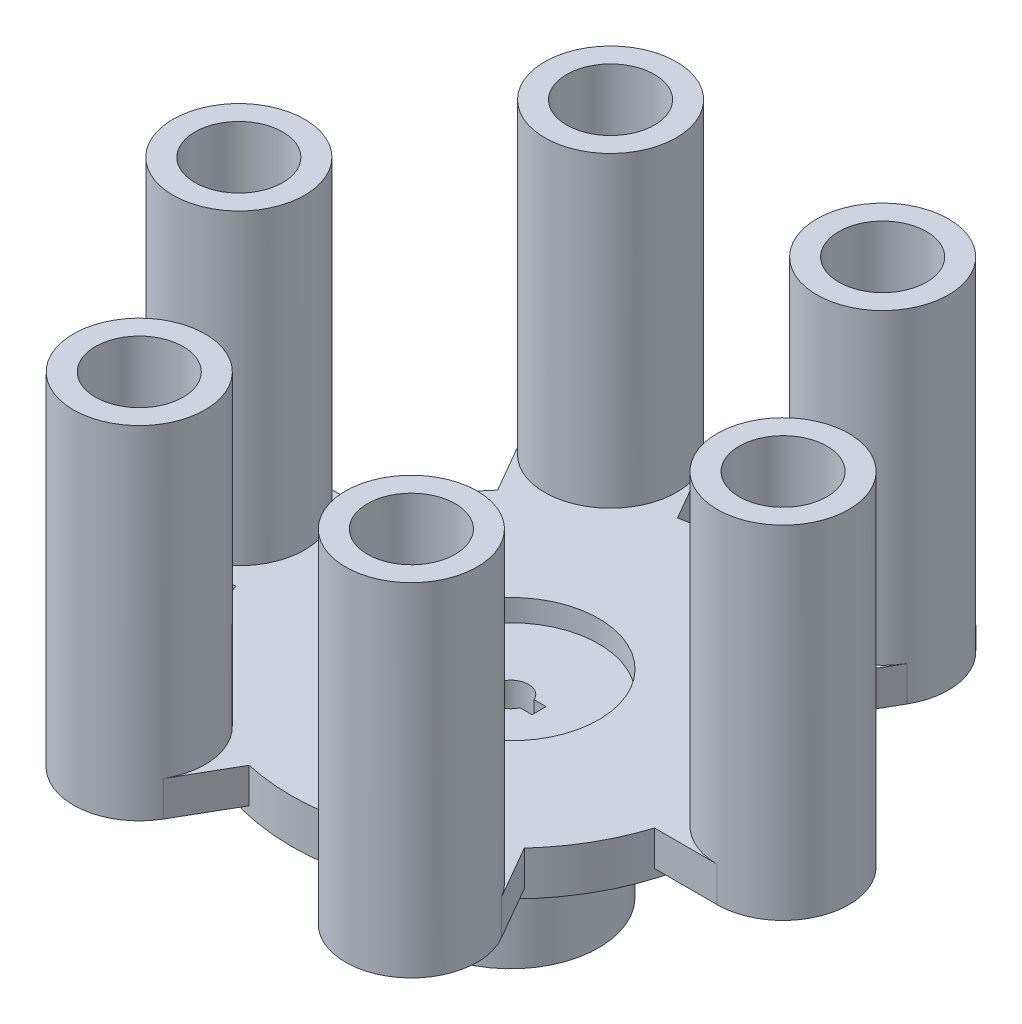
ISO-10303-21;
HEADER;
FILE_DESCRIPTION(('STEP AP214'),'2;1');
FILE_NAME('part.step','',(''),(''),'','','');
FILE_SCHEMA(('AUTOMOTIVE_DESIGN { 1 0 10303 214 1 1 1 1 }'));
ENDSEC;
DATA;
#1=APPLICATION_CONTEXT('core data for automotive mechanical design processes');
#2=APPLICATION_PROTOCOL_DEFINITION('international standard','automotive_design',2000,#1);
#3=PRODUCT_CONTEXT('',#1,'mechanical');
#4=PRODUCT('Part','Part','',(#3));
#5=PRODUCT_RELATED_PRODUCT_CATEGORY('part','',(#4));
#6=PRODUCT_DEFINITION_FORMATION('','',#4);
#7=PRODUCT_DEFINITION_CONTEXT('part definition',#1,'design');
#8=PRODUCT_DEFINITION('design','',#6,#7);
#9=PRODUCT_DEFINITION_SHAPE('','',#8);
#10=(LENGTH_UNIT() NAMED_UNIT(*) SI_UNIT(.MILLI.,.METRE.));
#11=(NAMED_UNIT(*) PLANE_ANGLE_UNIT() SI_UNIT($,.RADIAN.));
#12=(NAMED_UNIT(*) SI_UNIT($,.STERADIAN.) SOLID_ANGLE_UNIT());
#13=UNCERTAINTY_MEASURE_WITH_UNIT(LENGTH_MEASURE(1.E-05),#10,'distance_accuracy_value','');
#14=(GEOMETRIC_REPRESENTATION_CONTEXT(3) GLOBAL_UNCERTAINTY_ASSIGNED_CONTEXT((#13)) GLOBAL_UNIT_ASSIGNED_CONTEXT((#10,
#11,#12)) REPRESENTATION_CONTEXT('',''));
#15=CARTESIAN_POINT('',(0.,0.,0.));
#16=DIRECTION('',(0.,0.,1.));
#17=DIRECTION('',(1.,0.,0.));
#18=AXIS2_PLACEMENT_3D('',#15,#16,#17);
#19=CARTESIAN_POINT('',(0.,12.5,0.));
#20=DIRECTION('',(0.,1.,0.));
#21=DIRECTION('',(0.,0.,1.));
#22=AXIS2_PLACEMENT_3D('',#19,#20,#21);
#23=PLANE('',#22);
#24=CARTESIAN_POINT('',(0.,12.5,0.));
#25=DIRECTION('',(0.,1.,0.));
#26=DIRECTION('',(0.,0.,1.));
#27=AXIS2_PLACEMENT_3D('',#24,#25,#26);
#28=CIRCLE('',#27,10.);
#29=CARTESIAN_POINT('',(0.,12.5,10.));
#30=VERTEX_POINT('',#29);
#31=EDGE_CURVE('E393',#30,#30,#28,.T.);
#32=ORIENTED_EDGE('',*,*,#31,.F.);
#33=EDGE_LOOP('',(#32));
#34=FACE_BOUND('',#33,.T.);
#35=DIRECTION('',(-1.,0.,0.));
#36=VECTOR('',#35,1.);
#37=CARTESIAN_POINT('',(-31.0000000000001,12.5,-7.49999999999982));
#38=LINE('',#37,#36);
#39=CARTESIAN_POINT('',(-23.8484800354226,12.5,-7.49999999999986));
#40=VERTEX_POINT('',#39);
#41=CARTESIAN_POINT('',(-31.0000000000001,12.5,-7.49999999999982));
#42=VERTEX_POINT('',#41);
#43=EDGE_CURVE('E232',#40,#42,#38,.T.);
#44=ORIENTED_EDGE('',*,*,#43,.T.);
#45=CARTESIAN_POINT('',(-31.,12.5,2.20309881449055E-13));
#46=DIRECTION('',(0.,1.,0.));
#47=DIRECTION('',(-0.866025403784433,0.,0.50000000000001));
#48=AXIS2_PLACEMENT_3D('',#45,#46,#47);
#49=CIRCLE('',#48,7.49999999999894);
#50=CARTESIAN_POINT('',(-31.,12.5,7.49999999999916));
#51=VERTEX_POINT('',#50);
#52=EDGE_CURVE('E241',#51,#42,#49,.T.);
#53=ORIENTED_EDGE('',*,*,#52,.F.);
#54=DIRECTION('',(1.,0.,0.));
#55=VECTOR('',#54,1.);
#56=CARTESIAN_POINT('',(-30.9999999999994,12.5,7.49999999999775));
#57=LINE('',#56,#55);
#58=CARTESIAN_POINT('',(-23.8484800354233,12.5,7.49999999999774));
#59=VERTEX_POINT('',#58);
#60=EDGE_CURVE('E222',#51,#59,#57,.T.);
#61=ORIENTED_EDGE('',*,*,#60,.T.);
#62=CARTESIAN_POINT('',(0.,12.5,0.));
#63=DIRECTION('',(0.,1.,0.));
#64=DIRECTION('',(0.,0.,1.));
#65=AXIS2_PLACEMENT_3D('',#62,#63,#64);
#66=CIRCLE('',#65,24.999999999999);
#67=CARTESIAN_POINT('',(-18.4194305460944,12.5,16.9033895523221));
#68=VERTEX_POINT('',#67);
#69=EDGE_CURVE('E1133',#59,#68,#66,.T.);
#70=ORIENTED_EDGE('',*,*,#69,.T.);
#71=DIRECTION('',(-0.499999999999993,0.,0.866025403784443));
#72=VECTOR('',#71,1.);
#73=CARTESIAN_POINT('',(-21.9951905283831,12.5,23.0967875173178));
#74=LINE('',#73,#72);
#75=CARTESIAN_POINT('',(-21.9951905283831,12.5,23.0967875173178));
#76=VERTEX_POINT('',#75);
#77=EDGE_CURVE('E346',#68,#76,#74,.T.);
#78=ORIENTED_EDGE('',*,*,#77,.T.);
#79=CARTESIAN_POINT('',(-15.5000000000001,12.5,26.8467875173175));
#80=DIRECTION('',(0.,1.,0.));
#81=DIRECTION('',(0.,0.,1.));
#82=AXIS2_PLACEMENT_3D('',#79,#80,#81);
#83=CIRCLE('',#82,7.49999999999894);
#84=CARTESIAN_POINT('',(-9.00480947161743,12.5,30.5967875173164));
#85=VERTEX_POINT('',#84);
#86=EDGE_CURVE('E290',#85,#76,#83,.T.);
#87=ORIENTED_EDGE('',*,*,#86,.F.);
#88=DIRECTION('',(0.499999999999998,0.,-0.866025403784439));
#89=VECTOR('',#88,1.);
#90=CARTESIAN_POINT('',(-9.00480947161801,12.5,30.5967875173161));
#91=LINE('',#90,#89);
#92=CARTESIAN_POINT('',(-5.42904948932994,12.5,24.4033895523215));
#93=VERTEX_POINT('',#92);
#94=EDGE_CURVE('E340',#85,#93,#91,.T.);
#95=ORIENTED_EDGE('',*,*,#94,.T.);
#96=CARTESIAN_POINT('',(5.42904948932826,12.5,24.4033895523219));
#97=VERTEX_POINT('',#96);
#98=EDGE_CURVE('E1130',#93,#97,#66,.T.);
#99=ORIENTED_EDGE('',*,*,#98,.T.);
#100=DIRECTION('',(0.500000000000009,0.,0.866025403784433));
#101=VECTOR('',#100,1.);
#102=CARTESIAN_POINT('',(9.00480947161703,12.5,30.5967875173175));
#103=LINE('',#102,#101);
#104=CARTESIAN_POINT('',(9.00480947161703,12.5,30.5967875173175));
#105=VERTEX_POINT('',#104);
#106=EDGE_CURVE('E364',#97,#105,#103,.T.);
#107=ORIENTED_EDGE('',*,*,#106,.T.);
#108=CARTESIAN_POINT('',(15.4999999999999,12.5,26.8467875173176));
#109=DIRECTION('',(0.,1.,0.));
#110=DIRECTION('',(0.86602540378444,0.,0.499999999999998));
#111=AXIS2_PLACEMENT_3D('',#108,#109,#110);
#112=CIRCLE('',#111,7.49999999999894);
#113=CARTESIAN_POINT('',(21.9951905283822,12.5,23.0967875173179));
#114=VERTEX_POINT('',#113);
#115=EDGE_CURVE('E281',#114,#105,#112,.T.);
#116=ORIENTED_EDGE('',*,*,#115,.F.);
#117=DIRECTION('',(-0.500000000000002,0.,-0.866025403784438));
#118=VECTOR('',#117,1.);
#119=CARTESIAN_POINT('',(21.9951905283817,12.5,23.0967875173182));
#120=LINE('',#119,#118);
#121=CARTESIAN_POINT('',(18.4194305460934,12.5,16.9033895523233));
#122=VERTEX_POINT('',#121);
#123=EDGE_CURVE('E357',#114,#122,#120,.T.);
#124=ORIENTED_EDGE('',*,*,#123,.T.);
#125=CARTESIAN_POINT('',(23.8484800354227,12.5,7.4999999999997));
#126=VERTEX_POINT('',#125);
#127=EDGE_CURVE('E404',#122,#126,#66,.T.);
#128=ORIENTED_EDGE('',*,*,#127,.T.);
#129=DIRECTION('',(1.,0.,0.));
#130=VECTOR('',#129,1.);
#131=CARTESIAN_POINT('',(31.,12.5,7.49999999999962));
#132=LINE('',#131,#130);
#133=CARTESIAN_POINT('',(31.,12.5,7.49999999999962));
#134=VERTEX_POINT('',#133);
#135=EDGE_CURVE('E382',#126,#134,#132,.T.);
#136=ORIENTED_EDGE('',*,*,#135,.T.);
#137=CARTESIAN_POINT('',(31.,12.5,0.));
#138=DIRECTION('',(0.,1.,0.));
#139=DIRECTION('',(0.866025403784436,0.,-0.500000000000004));
#140=AXIS2_PLACEMENT_3D('',#137,#138,#139);
#141=CIRCLE('',#140,7.49999999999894);
#142=CARTESIAN_POINT('',(31.,12.5,-7.49999999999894));
#143=VERTEX_POINT('',#142);
#144=EDGE_CURVE('E272',#143,#134,#141,.T.);
#145=ORIENTED_EDGE('',*,*,#144,.F.);
#146=DIRECTION('',(-1.,0.,0.));
#147=VECTOR('',#146,1.);
#148=CARTESIAN_POINT('',(31.,12.5,-7.49999999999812));
#149=LINE('',#148,#147);
#150=CARTESIAN_POINT('',(23.8484800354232,12.5,-7.49999999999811));
#151=VERTEX_POINT('',#150);
#152=EDGE_CURVE('E375',#143,#151,#149,.T.);
#153=ORIENTED_EDGE('',*,*,#152,.T.);
#154=CARTESIAN_POINT('',(18.4194305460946,12.5,-16.903389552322));
#155=VERTEX_POINT('',#154);
#156=EDGE_CURVE('E399',#151,#155,#66,.T.);
#157=ORIENTED_EDGE('',*,*,#156,.T.);
#158=DIRECTION('',(0.499999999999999,0.,-0.866025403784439));
#159=VECTOR('',#158,1.);
#160=CARTESIAN_POINT('',(21.9951905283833,12.5,-23.0967875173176));
#161=LINE('',#160,#159);
#162=CARTESIAN_POINT('',(21.9951905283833,12.5,-23.0967875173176));
#163=VERTEX_POINT('',#162);
#164=EDGE_CURVE('E306',#155,#163,#161,.T.);
#165=ORIENTED_EDGE('',*,*,#164,.T.);
#166=CARTESIAN_POINT('',(15.5000000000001,12.5,-26.8467875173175));
#167=DIRECTION('',(0.,1.,0.));
#168=DIRECTION('',(0.,0.,-1.));
#169=AXIS2_PLACEMENT_3D('',#166,#167,#168);
#170=CIRCLE('',#169,7.49999999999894);
#171=CARTESIAN_POINT('',(9.00480947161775,12.5,-30.596787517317));
#172=VERTEX_POINT('',#171);
#173=EDGE_CURVE('E263',#172,#163,#170,.T.);
#174=ORIENTED_EDGE('',*,*,#173,.F.);
#175=DIRECTION('',(-0.499999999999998,0.,0.86602540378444));
#176=VECTOR('',#175,1.);
#177=CARTESIAN_POINT('',(9.00480947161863,12.5,-30.5967875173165));
#178=LINE('',#177,#176);
#179=CARTESIAN_POINT('',(5.4290494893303,12.5,-24.4033895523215));
#180=VERTEX_POINT('',#179);
#181=EDGE_CURVE('E54',#172,#180,#178,.T.);
#182=ORIENTED_EDGE('',*,*,#181,.T.);
#183=CARTESIAN_POINT('',(-5.42904948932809,12.5,-24.403389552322));
#184=VERTEX_POINT('',#183);
#185=EDGE_CURVE('E403',#180,#184,#66,.T.);
#186=ORIENTED_EDGE('',*,*,#185,.T.);
#187=DIRECTION('',(-0.500000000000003,0.,-0.866025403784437));
#188=VECTOR('',#187,1.);
#189=CARTESIAN_POINT('',(-9.00480947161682,12.5,-30.5967875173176));
#190=LINE('',#189,#188);
#191=CARTESIAN_POINT('',(-9.00480947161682,12.5,-30.5967875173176));
#192=VERTEX_POINT('',#191);
#193=EDGE_CURVE('E323',#184,#192,#190,.T.);
#194=ORIENTED_EDGE('',*,*,#193,.T.);
#195=CARTESIAN_POINT('',(-15.5000000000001,12.5,-26.8467875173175));
#196=DIRECTION('',(0.,1.,0.));
#197=DIRECTION('',(-0.866025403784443,0.,-0.499999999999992));
#198=AXIS2_PLACEMENT_3D('',#195,#196,#197);
#199=CIRCLE('',#198,7.49999999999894);
#200=CARTESIAN_POINT('',(-21.9951905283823,12.5,-23.0967875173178));
#201=VERTEX_POINT('',#200);
#202=EDGE_CURVE('E260',#201,#192,#199,.T.);
#203=ORIENTED_EDGE('',*,*,#202,.F.);
#204=DIRECTION('',(0.500000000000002,0.,0.866025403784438));
#205=VECTOR('',#204,1.);
#206=CARTESIAN_POINT('',(-21.995190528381,12.5,-23.0967875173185));
#207=LINE('',#206,#205);
#208=CARTESIAN_POINT('',(-18.4194305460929,12.5,-16.9033895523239));
#209=VERTEX_POINT('',#208);
#210=EDGE_CURVE('E61',#201,#209,#207,.T.);
#211=ORIENTED_EDGE('',*,*,#210,.T.);
#212=EDGE_CURVE('E1134',#209,#40,#66,.T.);
#213=ORIENTED_EDGE('',*,*,#212,.T.);
#214=EDGE_LOOP('',(#44,#53,#61,#70,#78,#87,#95,#99,#107,#116,#124,#128,#136,#145,#153,#157,#165,
#174,#182,#186,#194,#203,#211,#213));
#215=FACE_BOUND('',#214,.T.);
#216=ADVANCED_FACE('F37',(#34,#215),#23,.T.);
#217=CARTESIAN_POINT('',(0.,10.,0.));
#218=DIRECTION('',(0.,-1.,0.));
#219=DIRECTION('',(0.,0.,-1.));
#220=AXIS2_PLACEMENT_3D('',#217,#218,#219);
#221=CYLINDRICAL_SURFACE('',#220,10.);
#222=CARTESIAN_POINT('',(0.,-10.,0.));
#223=DIRECTION('',(0.,1.,0.));
#224=DIRECTION('',(0.,0.,1.));
#225=AXIS2_PLACEMENT_3D('',#222,#223,#224);
#226=CIRCLE('',#225,10.);
#227=CARTESIAN_POINT('',(0.,-10.,10.));
#228=VERTEX_POINT('',#227);
#229=EDGE_CURVE('E431',#228,#228,#226,.T.);
#230=ORIENTED_EDGE('',*,*,#229,.T.);
#231=EDGE_LOOP('',(#230));
#232=FACE_BOUND('',#231,.T.);
#233=CARTESIAN_POINT('',(0.,7.5,0.));
#234=DIRECTION('',(0.,1.,0.));
#235=DIRECTION('',(0.,0.,1.));
#236=AXIS2_PLACEMENT_3D('',#233,#234,#235);
#237=CIRCLE('',#236,10.);
#238=CARTESIAN_POINT('',(0.,7.5,10.));
#239=VERTEX_POINT('',#238);
#240=EDGE_CURVE('E443',#239,#239,#237,.T.);
#241=ORIENTED_EDGE('',*,*,#240,.F.);
#242=EDGE_LOOP('',(#241));
#243=FACE_BOUND('',#242,.T.);
#244=ADVANCED_FACE('F39',(#232,#243),#221,.T.);
#245=CARTESIAN_POINT('',(0.,10.,0.));
#246=DIRECTION('',(0.,1.,0.));
#247=DIRECTION('',(0.,0.,1.));
#248=AXIS2_PLACEMENT_3D('',#245,#246,#247);
#249=PLANE('',#248);
#250=DIRECTION('',(1.,0.,0.));
#251=VECTOR('',#250,1.);
#252=CARTESIAN_POINT('',(1.59788848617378,10.,0.8));
#253=LINE('',#252,#251);
#254=CARTESIAN_POINT('',(1.83303027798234,10.,0.8));
#255=VERTEX_POINT('',#254);
#256=CARTESIAN_POINT('',(3.2,10.,0.8));
#257=VERTEX_POINT('',#256);
#258=EDGE_CURVE('E414',#255,#257,#253,.T.);
#259=ORIENTED_EDGE('',*,*,#258,.F.);
#260=CARTESIAN_POINT('',(0.,10.,0.));
#261=DIRECTION('',(0.,1.,0.));
#262=DIRECTION('',(0.,0.,1.));
#263=AXIS2_PLACEMENT_3D('',#260,#261,#262);
#264=CIRCLE('',#263,2.);
#265=CARTESIAN_POINT('',(1.83303027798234,10.,-0.8));
#266=VERTEX_POINT('',#265);
#267=EDGE_CURVE('E428',#266,#255,#264,.T.);
#268=ORIENTED_EDGE('',*,*,#267,.F.);
#269=DIRECTION('',(-1.,0.,0.));
#270=VECTOR('',#269,1.);
#271=CARTESIAN_POINT('',(1.59788848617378,10.,-0.8));
#272=LINE('',#271,#270);
#273=CARTESIAN_POINT('',(3.2,10.,-0.8));
#274=VERTEX_POINT('',#273);
#275=EDGE_CURVE('E412',#274,#266,#272,.T.);
#276=ORIENTED_EDGE('',*,*,#275,.F.);
#277=DIRECTION('',(0.,0.,-1.));
#278=VECTOR('',#277,1.);
#279=CARTESIAN_POINT('',(3.2,10.,-0.8));
#280=LINE('',#279,#278);
#281=EDGE_CURVE('E409',#257,#274,#280,.T.);
#282=ORIENTED_EDGE('',*,*,#281,.F.);
#283=EDGE_LOOP('',(#259,#268,#276,#282));
#284=FACE_BOUND('',#283,.T.);
#285=CARTESIAN_POINT('',(0.,10.,0.));
#286=DIRECTION('',(0.,1.,0.));
#287=DIRECTION('',(0.,0.,1.));
#288=AXIS2_PLACEMENT_3D('',#285,#286,#287);
#289=CIRCLE('',#288,10.);
#290=CARTESIAN_POINT('',(0.,10.,10.));
#291=VERTEX_POINT('',#290);
#292=EDGE_CURVE('E402',#291,#291,#289,.F.);
#293=ORIENTED_EDGE('',*,*,#292,.F.);
#294=EDGE_LOOP('',(#293));
#295=FACE_BOUND('',#294,.T.);
#296=ADVANCED_FACE('F549',(#284,#295),#249,.T.);
#297=CARTESIAN_POINT('',(0.,-10.,0.));
#298=DIRECTION('',(0.,1.,0.));
#299=DIRECTION('',(0.,0.,1.));
#300=AXIS2_PLACEMENT_3D('',#297,#298,#299);
#301=PLANE('',#300);
#302=ORIENTED_EDGE('',*,*,#229,.F.);
#303=EDGE_LOOP('',(#302));
#304=FACE_BOUND('',#303,.T.);
#305=CARTESIAN_POINT('',(0.,-10.,0.));
#306=DIRECTION('',(0.,1.,0.));
#307=DIRECTION('',(0.,0.,1.));
#308=AXIS2_PLACEMENT_3D('',#305,#306,#307);
#309=CIRCLE('',#308,2.);
#310=CARTESIAN_POINT('',(1.83303027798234,-10.,-0.8));
#311=VERTEX_POINT('',#310);
#312=CARTESIAN_POINT('',(1.83303027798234,-10.,0.8));
#313=VERTEX_POINT('',#312);
#314=EDGE_CURVE('E427',#311,#313,#309,.T.);
#315=ORIENTED_EDGE('',*,*,#314,.T.);
#316=DIRECTION('',(1.,0.,0.));
#317=VECTOR('',#316,1.);
#318=CARTESIAN_POINT('',(0.,-10.,0.8));
#319=LINE('',#318,#317);
#320=CARTESIAN_POINT('',(3.2,-10.,0.8));
#321=VERTEX_POINT('',#320);
#322=EDGE_CURVE('E424',#313,#321,#319,.T.);
#323=ORIENTED_EDGE('',*,*,#322,.T.);
#324=DIRECTION('',(0.,0.,-1.));
#325=VECTOR('',#324,1.);
#326=CARTESIAN_POINT('',(3.2,-10.,0.));
#327=LINE('',#326,#325);
#328=CARTESIAN_POINT('',(3.2,-10.,-0.8));
#329=VERTEX_POINT('',#328);
#330=EDGE_CURVE('E440',#321,#329,#327,.T.);
#331=ORIENTED_EDGE('',*,*,#330,.T.);
#332=DIRECTION('',(-1.,0.,0.));
#333=VECTOR('',#332,1.);
#334=CARTESIAN_POINT('',(0.,-10.,-0.8));
#335=LINE('',#334,#333);
#336=EDGE_CURVE('E420',#329,#311,#335,.T.);
#337=ORIENTED_EDGE('',*,*,#336,.T.);
#338=EDGE_LOOP('',(#315,#323,#331,#337));
#339=FACE_BOUND('',#338,.T.);
#340=ADVANCED_FACE('F577',(#304,#339),#301,.F.);
#341=CARTESIAN_POINT('',(0.,10.,0.));
#342=DIRECTION('',(0.,-1.,0.));
#343=DIRECTION('',(0.,0.,-1.));
#344=AXIS2_PLACEMENT_3D('',#341,#342,#343);
#345=CYLINDRICAL_SURFACE('',#344,2.);
#346=DIRECTION('',(0.,-1.,0.));
#347=VECTOR('',#346,1.);
#348=CARTESIAN_POINT('',(1.83303027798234,10.,0.8));
#349=LINE('',#348,#347);
#350=EDGE_CURVE('E438',#313,#255,#349,.F.);
#351=ORIENTED_EDGE('',*,*,#350,.F.);
#352=ORIENTED_EDGE('',*,*,#314,.F.);
#353=DIRECTION('',(0.,-1.,0.));
#354=VECTOR('',#353,1.);
#355=CARTESIAN_POINT('',(1.83303027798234,10.,-0.8));
#356=LINE('',#355,#354);
#357=EDGE_CURVE('E436',#266,#311,#356,.T.);
#358=ORIENTED_EDGE('',*,*,#357,.F.);
#359=ORIENTED_EDGE('',*,*,#267,.T.);
#360=EDGE_LOOP('',(#351,#352,#358,#359));
#361=FACE_BOUND('',#360,.T.);
#362=ADVANCED_FACE('F573',(#361),#345,.F.);
#363=CARTESIAN_POINT('',(3.2,-20.,-0.8));
#364=DIRECTION('',(1.,0.,0.));
#365=DIRECTION('',(0.,0.,-1.));
#366=AXIS2_PLACEMENT_3D('',#363,#364,#365);
#367=PLANE('',#366);
#368=DIRECTION('',(0.,1.,0.));
#369=VECTOR('',#368,1.);
#370=CARTESIAN_POINT('',(3.2,-20.,0.8));
#371=LINE('',#370,#369);
#372=EDGE_CURVE('E418',#321,#257,#371,.T.);
#373=ORIENTED_EDGE('',*,*,#372,.T.);
#374=ORIENTED_EDGE('',*,*,#281,.T.);
#375=DIRECTION('',(0.,1.,0.));
#376=VECTOR('',#375,1.);
#377=CARTESIAN_POINT('',(3.2,-20.,-0.8));
#378=LINE('',#377,#376);
#379=EDGE_CURVE('E417',#329,#274,#378,.T.);
#380=ORIENTED_EDGE('',*,*,#379,.F.);
#381=ORIENTED_EDGE('',*,*,#330,.F.);
#382=EDGE_LOOP('',(#373,#374,#380,#381));
#383=FACE_BOUND('',#382,.T.);
#384=ADVANCED_FACE('F566',(#383),#367,.F.);
#385=CARTESIAN_POINT('',(1.59788848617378,-20.,0.8));
#386=DIRECTION('',(0.,0.,1.));
#387=DIRECTION('',(1.,0.,0.));
#388=AXIS2_PLACEMENT_3D('',#385,#386,#387);
#389=PLANE('',#388);
#390=ORIENTED_EDGE('',*,*,#350,.T.);
#391=ORIENTED_EDGE('',*,*,#258,.T.);
#392=ORIENTED_EDGE('',*,*,#372,.F.);
#393=ORIENTED_EDGE('',*,*,#322,.F.);
#394=EDGE_LOOP('',(#390,#391,#392,#393));
#395=FACE_BOUND('',#394,.T.);
#396=ADVANCED_FACE('F563',(#395),#389,.F.);
#397=CARTESIAN_POINT('',(1.59788848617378,-20.,-0.8));
#398=DIRECTION('',(0.,0.,-1.));
#399=DIRECTION('',(-1.,0.,0.));
#400=AXIS2_PLACEMENT_3D('',#397,#398,#399);
#401=PLANE('',#400);
#402=ORIENTED_EDGE('',*,*,#379,.T.);
#403=ORIENTED_EDGE('',*,*,#275,.T.);
#404=ORIENTED_EDGE('',*,*,#357,.T.);
#405=ORIENTED_EDGE('',*,*,#336,.F.);
#406=EDGE_LOOP('',(#402,#403,#404,#405));
#407=FACE_BOUND('',#406,.T.);
#408=ADVANCED_FACE('F558',(#407),#401,.F.);
#409=CARTESIAN_POINT('',(0.,7.5,0.));
#410=DIRECTION('',(0.,1.,0.));
#411=DIRECTION('',(0.,0.,1.));
#412=AXIS2_PLACEMENT_3D('',#409,#410,#411);
#413=PLANE('',#412);
#414=CARTESIAN_POINT('',(0.,7.5,0.));
#415=DIRECTION('',(0.,1.,0.));
#416=DIRECTION('',(0.,0.,1.));
#417=AXIS2_PLACEMENT_3D('',#414,#415,#416);
#418=CIRCLE('',#417,24.999999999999);
#419=CARTESIAN_POINT('',(0.,7.5,24.999999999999));
#420=VERTEX_POINT('',#419);
#421=EDGE_CURVE('E398',#420,#420,#418,.T.);
#422=ORIENTED_EDGE('',*,*,#421,.F.);
#423=EDGE_LOOP('',(#422));
#424=FACE_BOUND('',#423,.T.);
#425=ORIENTED_EDGE('',*,*,#240,.T.);
#426=EDGE_LOOP('',(#425));
#427=FACE_BOUND('',#426,.T.);
#428=ADVANCED_FACE('F554',(#424,#427),#413,.F.);
#429=CARTESIAN_POINT('',(0.,12.5,0.));
#430=DIRECTION('',(0.,-1.,0.));
#431=DIRECTION('',(0.,0.,-1.));
#432=AXIS2_PLACEMENT_3D('',#429,#430,#431);
#433=CYLINDRICAL_SURFACE('',#432,24.999999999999);
#434=CARTESIAN_POINT('',(0.,8.5,0.));
#435=DIRECTION('',(0.,1.,0.));
#436=DIRECTION('',(0.,0.,1.));
#437=AXIS2_PLACEMENT_3D('',#434,#435,#436);
#438=CIRCLE('',#437,24.999999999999);
#439=CARTESIAN_POINT('',(18.4194305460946,8.5,-16.903389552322));
#440=VERTEX_POINT('',#439);
#441=CARTESIAN_POINT('',(5.4290494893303,8.5,-24.4033895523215));
#442=VERTEX_POINT('',#441);
#443=EDGE_CURVE('E484',#440,#442,#438,.T.);
#444=ORIENTED_EDGE('',*,*,#443,.F.);
#445=DIRECTION('',(0.,-1.,0.));
#446=VECTOR('',#445,1.);
#447=CARTESIAN_POINT('',(18.4194305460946,12.5,-16.903389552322));
#448=LINE('',#447,#446);
#449=EDGE_CURVE('E11',#440,#155,#448,.F.);
#450=ORIENTED_EDGE('',*,*,#449,.T.);
#451=ORIENTED_EDGE('',*,*,#156,.F.);
#452=DIRECTION('',(0.,-1.,0.));
#453=VECTOR('',#452,1.);
#454=CARTESIAN_POINT('',(23.8484800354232,12.5,-7.49999999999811));
#455=LINE('',#454,#453);
#456=CARTESIAN_POINT('',(23.8484800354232,8.5,-7.49999999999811));
#457=VERTEX_POINT('',#456);
#458=EDGE_CURVE('E448',#151,#457,#455,.T.);
#459=ORIENTED_EDGE('',*,*,#458,.T.);
#460=CARTESIAN_POINT('',(0.,8.5,0.));
#461=DIRECTION('',(0.,1.,0.));
#462=DIRECTION('',(0.,0.,1.));
#463=AXIS2_PLACEMENT_3D('',#460,#461,#462);
#464=CIRCLE('',#463,24.999999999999);
#465=CARTESIAN_POINT('',(23.8484800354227,8.5,7.4999999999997));
#466=VERTEX_POINT('',#465);
#467=EDGE_CURVE('E446',#466,#457,#464,.T.);
#468=ORIENTED_EDGE('',*,*,#467,.F.);
#469=DIRECTION('',(0.,-1.,0.));
#470=VECTOR('',#469,1.);
#471=CARTESIAN_POINT('',(23.8484800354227,12.5,7.4999999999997));
#472=LINE('',#471,#470);
#473=EDGE_CURVE('E451',#466,#126,#472,.F.);
#474=ORIENTED_EDGE('',*,*,#473,.T.);
#475=ORIENTED_EDGE('',*,*,#127,.F.);
#476=DIRECTION('',(0.,-1.,0.));
#477=VECTOR('',#476,1.);
#478=CARTESIAN_POINT('',(18.4194305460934,12.5,16.9033895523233));
#479=LINE('',#478,#477);
#480=CARTESIAN_POINT('',(18.4194305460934,8.5,16.9033895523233));
#481=VERTEX_POINT('',#480);
#482=EDGE_CURVE('E456',#122,#481,#479,.T.);
#483=ORIENTED_EDGE('',*,*,#482,.T.);
#484=CARTESIAN_POINT('',(0.,8.5,0.));
#485=DIRECTION('',(0.,1.,0.));
#486=DIRECTION('',(0.,0.,1.));
#487=AXIS2_PLACEMENT_3D('',#484,#485,#486);
#488=CIRCLE('',#487,24.999999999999);
#489=CARTESIAN_POINT('',(5.42904948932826,8.5,24.4033895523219));
#490=VERTEX_POINT('',#489);
#491=EDGE_CURVE('E454',#490,#481,#488,.T.);
#492=ORIENTED_EDGE('',*,*,#491,.F.);
#493=DIRECTION('',(0.,-1.,0.));
#494=VECTOR('',#493,1.);
#495=CARTESIAN_POINT('',(5.42904948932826,12.5,24.4033895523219));
#496=LINE('',#495,#494);
#497=EDGE_CURVE('E459',#490,#97,#496,.F.);
#498=ORIENTED_EDGE('',*,*,#497,.T.);
#499=ORIENTED_EDGE('',*,*,#98,.F.);
#500=DIRECTION('',(0.,-1.,0.));
#501=VECTOR('',#500,1.);
#502=CARTESIAN_POINT('',(-5.42904948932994,12.5,24.4033895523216));
#503=LINE('',#502,#501);
#504=CARTESIAN_POINT('',(-5.42904948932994,8.5,24.4033895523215));
#505=VERTEX_POINT('',#504);
#506=EDGE_CURVE('E464',#93,#505,#503,.T.);
#507=ORIENTED_EDGE('',*,*,#506,.T.);
#508=CARTESIAN_POINT('',(0.,8.5,0.));
#509=DIRECTION('',(0.,1.,0.));
#510=DIRECTION('',(0.,0.,1.));
#511=AXIS2_PLACEMENT_3D('',#508,#509,#510);
#512=CIRCLE('',#511,24.999999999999);
#513=CARTESIAN_POINT('',(-18.4194305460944,8.5,16.9033895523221));
#514=VERTEX_POINT('',#513);
#515=EDGE_CURVE('E462',#514,#505,#512,.T.);
#516=ORIENTED_EDGE('',*,*,#515,.F.);
#517=DIRECTION('',(0.,-1.,0.));
#518=VECTOR('',#517,1.);
#519=CARTESIAN_POINT('',(-18.4194305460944,12.5,16.9033895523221));
#520=LINE('',#519,#518);
#521=EDGE_CURVE('E467',#514,#68,#520,.F.);
#522=ORIENTED_EDGE('',*,*,#521,.T.);
#523=ORIENTED_EDGE('',*,*,#69,.F.);
#524=DIRECTION('',(0.,-1.,0.));
#525=VECTOR('',#524,1.);
#526=CARTESIAN_POINT('',(-23.8484800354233,12.5,7.49999999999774));
#527=LINE('',#526,#525);
#528=CARTESIAN_POINT('',(-23.8484800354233,8.5,7.49999999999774));
#529=VERTEX_POINT('',#528);
#530=EDGE_CURVE('E229',#59,#529,#527,.T.);
#531=ORIENTED_EDGE('',*,*,#530,.T.);
#532=CARTESIAN_POINT('',(0.,8.5,0.));
#533=DIRECTION('',(0.,1.,0.));
#534=DIRECTION('',(0.,0.,1.));
#535=AXIS2_PLACEMENT_3D('',#532,#533,#534);
#536=CIRCLE('',#535,24.999999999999);
#537=CARTESIAN_POINT('',(-23.8484800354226,8.5,-7.49999999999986));
#538=VERTEX_POINT('',#537);
#539=EDGE_CURVE('E470',#538,#529,#536,.T.);
#540=ORIENTED_EDGE('',*,*,#539,.F.);
#541=DIRECTION('',(0.,-1.,0.));
#542=VECTOR('',#541,1.);
#543=CARTESIAN_POINT('',(-23.8484800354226,12.5,-7.49999999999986));
#544=LINE('',#543,#542);
#545=EDGE_CURVE('E473',#538,#40,#544,.F.);
#546=ORIENTED_EDGE('',*,*,#545,.T.);
#547=ORIENTED_EDGE('',*,*,#212,.F.);
#548=DIRECTION('',(0.,-1.,0.));
#549=VECTOR('',#548,1.);
#550=CARTESIAN_POINT('',(-18.4194305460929,12.5,-16.9033895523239));
#551=LINE('',#550,#549);
#552=CARTESIAN_POINT('',(-18.4194305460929,8.5,-16.9033895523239));
#553=VERTEX_POINT('',#552);
#554=EDGE_CURVE('E478',#209,#553,#551,.T.);
#555=ORIENTED_EDGE('',*,*,#554,.T.);
#556=CARTESIAN_POINT('',(0.,8.5,0.));
#557=DIRECTION('',(0.,1.,0.));
#558=DIRECTION('',(0.,0.,1.));
#559=AXIS2_PLACEMENT_3D('',#556,#557,#558);
#560=CIRCLE('',#559,24.999999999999);
#561=CARTESIAN_POINT('',(-5.42904948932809,8.5,-24.403389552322));
#562=VERTEX_POINT('',#561);
#563=EDGE_CURVE('E476',#562,#553,#560,.T.);
#564=ORIENTED_EDGE('',*,*,#563,.F.);
#565=DIRECTION('',(0.,-1.,0.));
#566=VECTOR('',#565,1.);
#567=CARTESIAN_POINT('',(-5.42904948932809,12.5,-24.403389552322));
#568=LINE('',#567,#566);
#569=EDGE_CURVE('E481',#562,#184,#568,.F.);
#570=ORIENTED_EDGE('',*,*,#569,.T.);
#571=ORIENTED_EDGE('',*,*,#185,.F.);
#572=DIRECTION('',(0.,-1.,0.));
#573=VECTOR('',#572,1.);
#574=CARTESIAN_POINT('',(5.4290494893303,12.5,-24.4033895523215));
#575=LINE('',#574,#573);
#576=EDGE_CURVE('E46',#180,#442,#575,.T.);
#577=ORIENTED_EDGE('',*,*,#576,.T.);
#578=EDGE_LOOP('',(#444,#450,#451,#459,#468,#474,#475,#483,#492,#498,#499,#507,#516,#522,#523,
#531,#540,#546,#547,#555,#564,#570,#571,#577));
#579=FACE_BOUND('',#578,.T.);
#580=ORIENTED_EDGE('',*,*,#421,.T.);
#581=EDGE_LOOP('',(#580));
#582=FACE_BOUND('',#581,.T.);
#583=ADVANCED_FACE('F557',(#579,#582),#433,.T.);
#584=CARTESIAN_POINT('',(0.,12.5,0.));
#585=DIRECTION('',(0.,-1.,0.));
#586=DIRECTION('',(0.,0.,-1.));
#587=AXIS2_PLACEMENT_3D('',#584,#585,#586);
#588=CYLINDRICAL_SURFACE('',#587,10.);
#589=ORIENTED_EDGE('',*,*,#292,.T.);
#590=EDGE_LOOP('',(#589));
#591=FACE_BOUND('',#590,.T.);
#592=ORIENTED_EDGE('',*,*,#31,.T.);
#593=EDGE_LOOP('',(#592));
#594=FACE_BOUND('',#593,.T.);
#595=ADVANCED_FACE('F553',(#591,#594),#588,.F.);
#596=CARTESIAN_POINT('',(31.,8.5,7.49999999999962));
#597=DIRECTION('',(0.,0.,1.));
#598=DIRECTION('',(1.,0.,0.));
#599=AXIS2_PLACEMENT_3D('',#596,#597,#598);
#600=PLANE('',#599);
#601=ORIENTED_EDGE('',*,*,#473,.F.);
#602=DIRECTION('',(1.,0.,0.));
#603=VECTOR('',#602,1.);
#604=CARTESIAN_POINT('',(31.,8.5,7.49999999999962));
#605=LINE('',#604,#603);
#606=CARTESIAN_POINT('',(31.,8.5,7.49999999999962));
#607=VERTEX_POINT('',#606);
#608=EDGE_CURVE('E385',#466,#607,#605,.T.);
#609=ORIENTED_EDGE('',*,*,#608,.T.);
#610=DIRECTION('',(0.,1.,0.));
#611=VECTOR('',#610,1.);
#612=CARTESIAN_POINT('',(31.,8.5,7.49999999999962));
#613=LINE('',#612,#611);
#614=EDGE_CURVE('E390',#607,#134,#613,.T.);
#615=ORIENTED_EDGE('',*,*,#614,.T.);
#616=ORIENTED_EDGE('',*,*,#135,.F.);
#617=EDGE_LOOP('',(#601,#609,#615,#616));
#618=FACE_BOUND('',#617,.T.);
#619=ADVANCED_FACE('F537',(#618),#600,.T.);
#620=CARTESIAN_POINT('',(31.,8.5,-7.49999999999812));
#621=DIRECTION('',(0.,0.,-1.));
#622=DIRECTION('',(-1.,0.,0.));
#623=AXIS2_PLACEMENT_3D('',#620,#621,#622);
#624=PLANE('',#623);
#625=ORIENTED_EDGE('',*,*,#458,.F.);
#626=ORIENTED_EDGE('',*,*,#152,.F.);
#627=DIRECTION('',(0.,1.,0.));
#628=VECTOR('',#627,1.);
#629=CARTESIAN_POINT('',(31.,8.5,-7.49999999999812));
#630=LINE('',#629,#628);
#631=CARTESIAN_POINT('',(31.,8.5,-7.49999999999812));
#632=VERTEX_POINT('',#631);
#633=EDGE_CURVE('E387',#632,#143,#630,.T.);
#634=ORIENTED_EDGE('',*,*,#633,.F.);
#635=DIRECTION('',(-1.,0.,0.));
#636=VECTOR('',#635,1.);
#637=CARTESIAN_POINT('',(31.,8.5,-7.49999999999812));
#638=LINE('',#637,#636);
#639=EDGE_CURVE('E381',#632,#457,#638,.T.);
#640=ORIENTED_EDGE('',*,*,#639,.T.);
#641=EDGE_LOOP('',(#625,#626,#634,#640));
#642=FACE_BOUND('',#641,.T.);
#643=ADVANCED_FACE('F526',(#642),#624,.T.);
#644=CARTESIAN_POINT('',(31.,8.5,0.));
#645=DIRECTION('',(0.,1.,0.));
#646=DIRECTION('',(0.,0.,1.));
#647=AXIS2_PLACEMENT_3D('',#644,#645,#646);
#648=CYLINDRICAL_SURFACE('',#647,7.49999999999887);
#649=ORIENTED_EDGE('',*,*,#633,.T.);
#650=ORIENTED_EDGE('',*,*,#144,.T.);
#651=ORIENTED_EDGE('',*,*,#614,.F.);
#652=CARTESIAN_POINT('',(31.,8.5,0.));
#653=DIRECTION('',(0.,1.,0.));
#654=DIRECTION('',(0.,0.,1.));
#655=AXIS2_PLACEMENT_3D('',#652,#653,#654);
#656=CIRCLE('',#655,7.49999999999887);
#657=EDGE_CURVE('E378',#607,#632,#656,.T.);
#658=ORIENTED_EDGE('',*,*,#657,.T.);
#659=EDGE_LOOP('',(#649,#650,#651,#658));
#660=FACE_BOUND('',#659,.T.);
#661=CARTESIAN_POINT('',(31.,47.5,0.));
#662=DIRECTION('',(0.,1.,0.));
#663=DIRECTION('',(0.866025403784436,0.,-0.500000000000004));
#664=AXIS2_PLACEMENT_3D('',#661,#662,#663);
#665=CIRCLE('',#664,7.49999999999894);
#666=CARTESIAN_POINT('',(37.4951905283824,47.5,-3.7499999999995));
#667=VERTEX_POINT('',#666);
#668=EDGE_CURVE('E278',#667,#667,#665,.T.);
#669=ORIENTED_EDGE('',*,*,#668,.F.);
#670=EDGE_LOOP('',(#669));
#671=FACE_BOUND('',#670,.T.);
#672=ADVANCED_FACE('F524',(#660,#671),#648,.T.);
#673=CARTESIAN_POINT('',(31.,8.5,0.));
#674=DIRECTION('',(0.,1.,0.));
#675=DIRECTION('',(0.,0.,1.));
#676=AXIS2_PLACEMENT_3D('',#673,#674,#675);
#677=PLANE('',#676);
#678=CARTESIAN_POINT('',(31.,8.5,2.46330733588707E-13));
#679=DIRECTION('',(0.,1.,0.));
#680=DIRECTION('',(0.,0.,1.));
#681=AXIS2_PLACEMENT_3D('',#678,#679,#680);
#682=CIRCLE('',#681,5.);
#683=CARTESIAN_POINT('',(31.,8.5,5.00000000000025));
#684=VERTEX_POINT('',#683);
#685=EDGE_CURVE('E41',#684,#684,#682,.T.);
#686=ORIENTED_EDGE('',*,*,#685,.T.);
#687=EDGE_LOOP('',(#686));
#688=FACE_BOUND('',#687,.T.);
#689=ORIENTED_EDGE('',*,*,#608,.F.);
#690=ORIENTED_EDGE('',*,*,#467,.T.);
#691=ORIENTED_EDGE('',*,*,#639,.F.);
#692=ORIENTED_EDGE('',*,*,#657,.F.);
#693=EDGE_LOOP('',(#689,#690,#691,#692));
#694=FACE_BOUND('',#693,.T.);
#695=ADVANCED_FACE('F505',(#688,#694),#677,.F.);
#696=CARTESIAN_POINT('',(9.00480947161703,8.5,30.5967875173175));
#697=DIRECTION('',(-0.866025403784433,0.,0.500000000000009));
#698=DIRECTION('',(0.500000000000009,0.,0.866025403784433));
#699=AXIS2_PLACEMENT_3D('',#696,#697,#698);
#700=PLANE('',#699);
#701=ORIENTED_EDGE('',*,*,#497,.F.);
#702=DIRECTION('',(0.500000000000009,0.,0.866025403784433));
#703=VECTOR('',#702,1.);
#704=CARTESIAN_POINT('',(9.00480947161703,8.5,30.5967875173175));
#705=LINE('',#704,#703);
#706=CARTESIAN_POINT('',(9.00480947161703,8.5,30.5967875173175));
#707=VERTEX_POINT('',#706);
#708=EDGE_CURVE('E367',#490,#707,#705,.T.);
#709=ORIENTED_EDGE('',*,*,#708,.T.);
#710=DIRECTION('',(0.,1.,0.));
#711=VECTOR('',#710,1.);
#712=CARTESIAN_POINT('',(9.00480947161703,8.5,30.5967875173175));
#713=LINE('',#712,#711);
#714=EDGE_CURVE('E372',#707,#105,#713,.T.);
#715=ORIENTED_EDGE('',*,*,#714,.T.);
#716=ORIENTED_EDGE('',*,*,#106,.F.);
#717=EDGE_LOOP('',(#701,#709,#715,#716));
#718=FACE_BOUND('',#717,.T.);
#719=ADVANCED_FACE('F534',(#718),#700,.T.);
#720=CARTESIAN_POINT('',(21.9951905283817,8.5,23.0967875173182));
#721=DIRECTION('',(0.866025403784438,0.,-0.500000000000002));
#722=DIRECTION('',(-0.500000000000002,0.,-0.866025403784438));
#723=AXIS2_PLACEMENT_3D('',#720,#721,#722);
#724=PLANE('',#723);
#725=ORIENTED_EDGE('',*,*,#482,.F.);
#726=ORIENTED_EDGE('',*,*,#123,.F.);
#727=DIRECTION('',(0.,1.,0.));
#728=VECTOR('',#727,1.);
#729=CARTESIAN_POINT('',(21.9951905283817,8.5,23.0967875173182));
#730=LINE('',#729,#728);
#731=CARTESIAN_POINT('',(21.9951905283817,8.5,23.0967875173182));
#732=VERTEX_POINT('',#731);
#733=EDGE_CURVE('E369',#732,#114,#730,.T.);
#734=ORIENTED_EDGE('',*,*,#733,.F.);
#735=DIRECTION('',(-0.500000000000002,0.,-0.866025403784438));
#736=VECTOR('',#735,1.);
#737=CARTESIAN_POINT('',(21.9951905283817,8.5,23.0967875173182));
#738=LINE('',#737,#736);
#739=EDGE_CURVE('E363',#732,#481,#738,.T.);
#740=ORIENTED_EDGE('',*,*,#739,.T.);
#741=EDGE_LOOP('',(#725,#726,#734,#740));
#742=FACE_BOUND('',#741,.T.);
#743=ADVANCED_FACE('F612',(#742),#724,.T.);
#744=CARTESIAN_POINT('',(15.5,8.5,26.8467875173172));
#745=DIRECTION('',(0.,1.,0.));
#746=DIRECTION('',(0.,0.,1.));
#747=AXIS2_PLACEMENT_3D('',#744,#745,#746);
#748=CYLINDRICAL_SURFACE('',#747,7.499999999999);
#749=ORIENTED_EDGE('',*,*,#733,.T.);
#750=ORIENTED_EDGE('',*,*,#115,.T.);
#751=ORIENTED_EDGE('',*,*,#714,.F.);
#752=CARTESIAN_POINT('',(15.5,8.5,26.8467875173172));
#753=DIRECTION('',(0.,1.,0.));
#754=DIRECTION('',(0.,0.,1.));
#755=AXIS2_PLACEMENT_3D('',#752,#753,#754);
#756=CIRCLE('',#755,7.499999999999);
#757=EDGE_CURVE('E360',#707,#732,#756,.T.);
#758=ORIENTED_EDGE('',*,*,#757,.T.);
#759=EDGE_LOOP('',(#749,#750,#751,#758));
#760=FACE_BOUND('',#759,.T.);
#761=CARTESIAN_POINT('',(15.4999999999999,47.5,26.8467875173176));
#762=DIRECTION('',(0.,1.,0.));
#763=DIRECTION('',(0.86602540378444,0.,0.499999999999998));
#764=AXIS2_PLACEMENT_3D('',#761,#762,#763);
#765=CIRCLE('',#764,7.49999999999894);
#766=CARTESIAN_POINT('',(21.9951905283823,47.5,30.5967875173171));
#767=VERTEX_POINT('',#766);
#768=EDGE_CURVE('E287',#767,#767,#765,.T.);
#769=ORIENTED_EDGE('',*,*,#768,.F.);
#770=EDGE_LOOP('',(#769));
#771=FACE_BOUND('',#770,.T.);
#772=ADVANCED_FACE('F609',(#760,#771),#748,.T.);
#773=CARTESIAN_POINT('',(15.5,8.5,26.8467875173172));
#774=DIRECTION('',(0.,1.,0.));
#775=DIRECTION('',(0.,0.,1.));
#776=AXIS2_PLACEMENT_3D('',#773,#774,#775);
#777=PLANE('',#776);
#778=CARTESIAN_POINT('',(15.4999999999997,8.5,26.8467875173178));
#779=DIRECTION('',(0.,1.,0.));
#780=DIRECTION('',(0.,0.,1.));
#781=AXIS2_PLACEMENT_3D('',#778,#779,#780);
#782=CIRCLE('',#781,5.0000000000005);
#783=CARTESIAN_POINT('',(15.4999999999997,8.5,31.8467875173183));
#784=VERTEX_POINT('',#783);
#785=EDGE_CURVE('E498',#784,#784,#782,.T.);
#786=ORIENTED_EDGE('',*,*,#785,.T.);
#787=EDGE_LOOP('',(#786));
#788=FACE_BOUND('',#787,.T.);
#789=ORIENTED_EDGE('',*,*,#708,.F.);
#790=ORIENTED_EDGE('',*,*,#491,.T.);
#791=ORIENTED_EDGE('',*,*,#739,.F.);
#792=ORIENTED_EDGE('',*,*,#757,.F.);
#793=EDGE_LOOP('',(#789,#790,#791,#792));
#794=FACE_BOUND('',#793,.T.);
#795=ADVANCED_FACE('F611',(#788,#794),#777,.F.);
#796=CARTESIAN_POINT('',(-21.9951905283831,8.5,23.0967875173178));
#797=DIRECTION('',(-0.866025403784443,0.,-0.499999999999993));
#798=DIRECTION('',(-0.499999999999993,0.,0.866025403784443));
#799=AXIS2_PLACEMENT_3D('',#796,#797,#798);
#800=PLANE('',#799);
#801=ORIENTED_EDGE('',*,*,#521,.F.);
#802=DIRECTION('',(-0.499999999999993,0.,0.866025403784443));
#803=VECTOR('',#802,1.);
#804=CARTESIAN_POINT('',(-21.9951905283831,8.5,23.0967875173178));
#805=LINE('',#804,#803);
#806=CARTESIAN_POINT('',(-21.9951905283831,8.5,23.0967875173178));
#807=VERTEX_POINT('',#806);
#808=EDGE_CURVE('E349',#514,#807,#805,.T.);
#809=ORIENTED_EDGE('',*,*,#808,.T.);
#810=DIRECTION('',(0.,1.,0.));
#811=VECTOR('',#810,1.);
#812=CARTESIAN_POINT('',(-21.9951905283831,8.5,23.0967875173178));
#813=LINE('',#812,#811);
#814=EDGE_CURVE('E354',#807,#76,#813,.T.);
#815=ORIENTED_EDGE('',*,*,#814,.T.);
#816=ORIENTED_EDGE('',*,*,#77,.F.);
#817=EDGE_LOOP('',(#801,#809,#815,#816));
#818=FACE_BOUND('',#817,.T.);
#819=ADVANCED_FACE('F622',(#818),#800,.T.);
#820=CARTESIAN_POINT('',(-9.00480947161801,8.5,30.5967875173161));
#821=DIRECTION('',(0.86602540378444,0.,0.499999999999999));
#822=DIRECTION('',(0.499999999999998,0.,-0.866025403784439));
#823=AXIS2_PLACEMENT_3D('',#820,#821,#822);
#824=PLANE('',#823);
#825=ORIENTED_EDGE('',*,*,#506,.F.);
#826=ORIENTED_EDGE('',*,*,#94,.F.);
#827=DIRECTION('',(0.,1.,0.));
#828=VECTOR('',#827,1.);
#829=CARTESIAN_POINT('',(-9.00480947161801,8.5,30.5967875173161));
#830=LINE('',#829,#828);
#831=CARTESIAN_POINT('',(-9.00480947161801,8.5,30.5967875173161));
#832=VERTEX_POINT('',#831);
#833=EDGE_CURVE('E351',#832,#85,#830,.T.);
#834=ORIENTED_EDGE('',*,*,#833,.F.);
#835=DIRECTION('',(0.499999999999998,0.,-0.866025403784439));
#836=VECTOR('',#835,1.);
#837=CARTESIAN_POINT('',(-9.00480947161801,8.5,30.5967875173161));
#838=LINE('',#837,#836);
#839=EDGE_CURVE('E345',#832,#505,#838,.T.);
#840=ORIENTED_EDGE('',*,*,#839,.T.);
#841=EDGE_LOOP('',(#825,#826,#834,#840));
#842=FACE_BOUND('',#841,.T.);
#843=ADVANCED_FACE('F627',(#842),#824,.T.);
#844=CARTESIAN_POINT('',(-15.5000000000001,8.5,26.8467875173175));
#845=DIRECTION('',(0.,1.,0.));
#846=DIRECTION('',(0.,0.,1.));
#847=AXIS2_PLACEMENT_3D('',#844,#845,#846);
#848=CYLINDRICAL_SURFACE('',#847,7.49999999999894);
#849=ORIENTED_EDGE('',*,*,#833,.T.);
#850=ORIENTED_EDGE('',*,*,#86,.T.);
#851=ORIENTED_EDGE('',*,*,#814,.F.);
#852=CARTESIAN_POINT('',(-15.5000000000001,8.5,26.8467875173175));
#853=DIRECTION('',(0.,1.,0.));
#854=DIRECTION('',(0.,0.,1.));
#855=AXIS2_PLACEMENT_3D('',#852,#853,#854);
#856=CIRCLE('',#855,7.49999999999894);
#857=EDGE_CURVE('E342',#807,#832,#856,.T.);
#858=ORIENTED_EDGE('',*,*,#857,.T.);
#859=EDGE_LOOP('',(#849,#850,#851,#858));
#860=FACE_BOUND('',#859,.T.);
#861=CARTESIAN_POINT('',(-15.5000000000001,47.5,26.8467875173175));
#862=DIRECTION('',(0.,1.,0.));
#863=DIRECTION('',(0.,0.,1.));
#864=AXIS2_PLACEMENT_3D('',#861,#862,#863);
#865=CIRCLE('',#864,7.49999999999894);
#866=CARTESIAN_POINT('',(-15.5000000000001,47.5,34.3467875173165));
#867=VERTEX_POINT('',#866);
#868=EDGE_CURVE('E296',#867,#867,#865,.T.);
#869=ORIENTED_EDGE('',*,*,#868,.F.);
#870=EDGE_LOOP('',(#869));
#871=FACE_BOUND('',#870,.T.);
#872=ADVANCED_FACE('F623',(#860,#871),#848,.T.);
#873=CARTESIAN_POINT('',(-15.5000000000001,8.5,26.8467875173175));
#874=DIRECTION('',(0.,1.,0.));
#875=DIRECTION('',(0.,0.,1.));
#876=AXIS2_PLACEMENT_3D('',#873,#874,#875);
#877=PLANE('',#876);
#878=CARTESIAN_POINT('',(-15.5,8.5,26.8467875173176));
#879=DIRECTION('',(0.,1.,0.));
#880=DIRECTION('',(0.,0.,1.));
#881=AXIS2_PLACEMENT_3D('',#878,#879,#880);
#882=CIRCLE('',#881,5.00000000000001);
#883=CARTESIAN_POINT('',(-15.5,8.5,31.8467875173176));
#884=VERTEX_POINT('',#883);
#885=EDGE_CURVE('E496',#884,#884,#882,.T.);
#886=ORIENTED_EDGE('',*,*,#885,.T.);
#887=EDGE_LOOP('',(#886));
#888=FACE_BOUND('',#887,.T.);
#889=ORIENTED_EDGE('',*,*,#808,.F.);
#890=ORIENTED_EDGE('',*,*,#515,.T.);
#891=ORIENTED_EDGE('',*,*,#839,.F.);
#892=ORIENTED_EDGE('',*,*,#857,.F.);
#893=EDGE_LOOP('',(#889,#890,#891,#892));
#894=FACE_BOUND('',#893,.T.);
#895=ADVANCED_FACE('F626',(#888,#894),#877,.F.);
#896=CARTESIAN_POINT('',(-31.0000000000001,8.5,-7.49999999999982));
#897=DIRECTION('',(0.,0.,-1.));
#898=DIRECTION('',(-1.,0.,0.));
#899=AXIS2_PLACEMENT_3D('',#896,#897,#898);
#900=PLANE('',#899);
#901=ORIENTED_EDGE('',*,*,#545,.F.);
#902=DIRECTION('',(-1.,0.,0.));
#903=VECTOR('',#902,1.);
#904=CARTESIAN_POINT('',(-31.0000000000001,8.5,-7.49999999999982));
#905=LINE('',#904,#903);
#906=CARTESIAN_POINT('',(-31.0000000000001,8.5,-7.49999999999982));
#907=VERTEX_POINT('',#906);
#908=EDGE_CURVE('E245',#538,#907,#905,.T.);
#909=ORIENTED_EDGE('',*,*,#908,.T.);
#910=DIRECTION('',(0.,1.,0.));
#911=VECTOR('',#910,1.);
#912=CARTESIAN_POINT('',(-31.0000000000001,8.5,-7.49999999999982));
#913=LINE('',#912,#911);
#914=EDGE_CURVE('E244',#907,#42,#913,.T.);
#915=ORIENTED_EDGE('',*,*,#914,.T.);
#916=ORIENTED_EDGE('',*,*,#43,.F.);
#917=EDGE_LOOP('',(#901,#909,#915,#916));
#918=FACE_BOUND('',#917,.T.);
#919=ADVANCED_FACE('F637',(#918),#900,.T.);
#920=CARTESIAN_POINT('',(-30.9999999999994,8.5,7.49999999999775));
#921=DIRECTION('',(0.,0.,1.));
#922=DIRECTION('',(1.,0.,0.));
#923=AXIS2_PLACEMENT_3D('',#920,#921,#922);
#924=PLANE('',#923);
#925=ORIENTED_EDGE('',*,*,#530,.F.);
#926=ORIENTED_EDGE('',*,*,#60,.F.);
#927=DIRECTION('',(0.,1.,0.));
#928=VECTOR('',#927,1.);
#929=CARTESIAN_POINT('',(-30.9999999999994,8.5,7.49999999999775));
#930=LINE('',#929,#928);
#931=CARTESIAN_POINT('',(-30.9999999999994,8.5,7.49999999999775));
#932=VERTEX_POINT('',#931);
#933=EDGE_CURVE('E226',#932,#51,#930,.T.);
#934=ORIENTED_EDGE('',*,*,#933,.F.);
#935=DIRECTION('',(1.,0.,0.));
#936=VECTOR('',#935,1.);
#937=CARTESIAN_POINT('',(-30.9999999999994,8.5,7.49999999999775));
#938=LINE('',#937,#936);
#939=EDGE_CURVE('E336',#932,#529,#938,.T.);
#940=ORIENTED_EDGE('',*,*,#939,.T.);
#941=EDGE_LOOP('',(#925,#926,#934,#940));
#942=FACE_BOUND('',#941,.T.);
#943=ADVANCED_FACE('F224',(#942),#924,.T.);
#944=CARTESIAN_POINT('',(-31.,8.5,-2.16471843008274E-13));
#945=DIRECTION('',(0.,1.,0.));
#946=DIRECTION('',(0.,0.,1.));
#947=AXIS2_PLACEMENT_3D('',#944,#945,#946);
#948=CYLINDRICAL_SURFACE('',#947,7.49999999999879);
#949=ORIENTED_EDGE('',*,*,#933,.T.);
#950=ORIENTED_EDGE('',*,*,#52,.T.);
#951=ORIENTED_EDGE('',*,*,#914,.F.);
#952=CARTESIAN_POINT('',(-31.,8.5,-2.16471843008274E-13));
#953=DIRECTION('',(0.,1.,0.));
#954=DIRECTION('',(0.,0.,1.));
#955=AXIS2_PLACEMENT_3D('',#952,#953,#954);
#956=CIRCLE('',#955,7.49999999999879);
#957=EDGE_CURVE('E243',#907,#932,#956,.T.);
#958=ORIENTED_EDGE('',*,*,#957,.T.);
#959=EDGE_LOOP('',(#949,#950,#951,#958));
#960=FACE_BOUND('',#959,.T.);
#961=CARTESIAN_POINT('',(-31.,47.5,2.20309881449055E-13));
#962=DIRECTION('',(0.,1.,0.));
#963=DIRECTION('',(-0.866025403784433,0.,0.50000000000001));
#964=AXIS2_PLACEMENT_3D('',#961,#962,#963);
#965=CIRCLE('',#964,7.49999999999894);
#966=CARTESIAN_POINT('',(-37.4951905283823,47.5,3.74999999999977));
#967=VERTEX_POINT('',#966);
#968=EDGE_CURVE('E252',#967,#967,#965,.T.);
#969=ORIENTED_EDGE('',*,*,#968,.F.);
#970=EDGE_LOOP('',(#969));
#971=FACE_BOUND('',#970,.T.);
#972=ADVANCED_FACE('F238',(#960,#971),#948,.T.);
#973=CARTESIAN_POINT('',(-31.,8.5,-2.16471843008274E-13));
#974=DIRECTION('',(0.,1.,0.));
#975=DIRECTION('',(0.,0.,1.));
#976=AXIS2_PLACEMENT_3D('',#973,#974,#975);
#977=PLANE('',#976);
#978=CARTESIAN_POINT('',(-31.,8.5,0.));
#979=DIRECTION('',(0.,1.,0.));
#980=DIRECTION('',(0.,0.,1.));
#981=AXIS2_PLACEMENT_3D('',#978,#979,#980);
#982=CIRCLE('',#981,5.);
#983=CARTESIAN_POINT('',(-31.,8.5,4.99999999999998));
#984=VERTEX_POINT('',#983);
#985=EDGE_CURVE('E493',#984,#984,#982,.T.);
#986=ORIENTED_EDGE('',*,*,#985,.T.);
#987=EDGE_LOOP('',(#986));
#988=FACE_BOUND('',#987,.T.);
#989=ORIENTED_EDGE('',*,*,#908,.F.);
#990=ORIENTED_EDGE('',*,*,#539,.T.);
#991=ORIENTED_EDGE('',*,*,#939,.F.);
#992=ORIENTED_EDGE('',*,*,#957,.F.);
#993=EDGE_LOOP('',(#989,#990,#991,#992));
#994=FACE_BOUND('',#993,.T.);
#995=ADVANCED_FACE('F641',(#988,#994),#977,.F.);
#996=CARTESIAN_POINT('',(-9.00480947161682,8.5,-30.5967875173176));
#997=DIRECTION('',(0.866025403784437,0.,-0.500000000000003));
#998=DIRECTION('',(-0.500000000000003,0.,-0.866025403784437));
#999=AXIS2_PLACEMENT_3D('',#996,#997,#998);
#1000=PLANE('',#999);
#1001=ORIENTED_EDGE('',*,*,#569,.F.);
#1002=DIRECTION('',(-0.500000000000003,0.,-0.866025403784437));
#1003=VECTOR('',#1002,1.);
#1004=CARTESIAN_POINT('',(-9.00480947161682,8.5,-30.5967875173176));
#1005=LINE('',#1004,#1003);
#1006=CARTESIAN_POINT('',(-9.00480947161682,8.5,-30.5967875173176));
#1007=VERTEX_POINT('',#1006);
#1008=EDGE_CURVE('E326',#562,#1007,#1005,.T.);
#1009=ORIENTED_EDGE('',*,*,#1008,.T.);
#1010=DIRECTION('',(0.,1.,0.));
#1011=VECTOR('',#1010,1.);
#1012=CARTESIAN_POINT('',(-9.00480947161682,8.5,-30.5967875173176));
#1013=LINE('',#1012,#1011);
#1014=EDGE_CURVE('E233',#1007,#192,#1013,.T.);
#1015=ORIENTED_EDGE('',*,*,#1014,.T.);
#1016=ORIENTED_EDGE('',*,*,#193,.F.);
#1017=EDGE_LOOP('',(#1001,#1009,#1015,#1016));
#1018=FACE_BOUND('',#1017,.T.);
#1019=ADVANCED_FACE('F649',(#1018),#1000,.T.);
#1020=CARTESIAN_POINT('',(-21.995190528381,8.5,-23.0967875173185));
#1021=DIRECTION('',(-0.866025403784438,0.,0.500000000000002));
#1022=DIRECTION('',(0.500000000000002,0.,0.866025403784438));
#1023=AXIS2_PLACEMENT_3D('',#1020,#1021,#1022);
#1024=PLANE('',#1023);
#1025=ORIENTED_EDGE('',*,*,#554,.F.);
#1026=ORIENTED_EDGE('',*,*,#210,.F.);
#1027=DIRECTION('',(0.,1.,0.));
#1028=VECTOR('',#1027,1.);
#1029=CARTESIAN_POINT('',(-21.995190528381,8.5,-23.0967875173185));
#1030=LINE('',#1029,#1028);
#1031=CARTESIAN_POINT('',(-21.995190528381,8.5,-23.0967875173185));
#1032=VERTEX_POINT('',#1031);
#1033=EDGE_CURVE('E328',#1032,#201,#1030,.T.);
#1034=ORIENTED_EDGE('',*,*,#1033,.F.);
#1035=DIRECTION('',(0.500000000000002,0.,0.866025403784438));
#1036=VECTOR('',#1035,1.);
#1037=CARTESIAN_POINT('',(-21.995190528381,8.5,-23.0967875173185));
#1038=LINE('',#1037,#1036);
#1039=EDGE_CURVE('E322',#1032,#553,#1038,.T.);
#1040=ORIENTED_EDGE('',*,*,#1039,.T.);
#1041=EDGE_LOOP('',(#1025,#1026,#1034,#1040));
#1042=FACE_BOUND('',#1041,.T.);
#1043=ADVANCED_FACE('F655',(#1042),#1024,.T.);
#1044=CARTESIAN_POINT('',(-15.4999999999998,8.5,-26.8467875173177));
#1045=DIRECTION('',(0.,1.,0.));
#1046=DIRECTION('',(0.,0.,1.));
#1047=AXIS2_PLACEMENT_3D('',#1044,#1045,#1046);
#1048=CYLINDRICAL_SURFACE('',#1047,7.49999999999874);
#1049=ORIENTED_EDGE('',*,*,#1033,.T.);
#1050=ORIENTED_EDGE('',*,*,#202,.T.);
#1051=ORIENTED_EDGE('',*,*,#1014,.F.);
#1052=CARTESIAN_POINT('',(-15.4999999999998,8.5,-26.8467875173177));
#1053=DIRECTION('',(0.,1.,0.));
#1054=DIRECTION('',(0.,0.,1.));
#1055=AXIS2_PLACEMENT_3D('',#1052,#1053,#1054);
#1056=CIRCLE('',#1055,7.49999999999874);
#1057=EDGE_CURVE('E319',#1007,#1032,#1056,.T.);
#1058=ORIENTED_EDGE('',*,*,#1057,.T.);
#1059=EDGE_LOOP('',(#1049,#1050,#1051,#1058));
#1060=FACE_BOUND('',#1059,.T.);
#1061=CARTESIAN_POINT('',(-15.5000000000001,47.5,-26.8467875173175));
#1062=DIRECTION('',(0.,1.,0.));
#1063=DIRECTION('',(-0.866025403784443,0.,-0.499999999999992));
#1064=AXIS2_PLACEMENT_3D('',#1061,#1062,#1063);
#1065=CIRCLE('',#1064,7.49999999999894);
#1066=CARTESIAN_POINT('',(-21.9951905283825,47.5,-30.5967875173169));
#1067=VERTEX_POINT('',#1066);
#1068=EDGE_CURVE('E259',#1067,#1067,#1065,.T.);
#1069=ORIENTED_EDGE('',*,*,#1068,.F.);
#1070=EDGE_LOOP('',(#1069));
#1071=FACE_BOUND('',#1070,.T.);
#1072=ADVANCED_FACE('F651',(#1060,#1071),#1048,.T.);
#1073=CARTESIAN_POINT('',(-15.4999999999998,8.5,-26.8467875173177));
#1074=DIRECTION('',(0.,1.,0.));
#1075=DIRECTION('',(0.,0.,1.));
#1076=AXIS2_PLACEMENT_3D('',#1073,#1074,#1075);
#1077=PLANE('',#1076);
#1078=CARTESIAN_POINT('',(-15.4999999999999,8.5,-26.8467875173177));
#1079=DIRECTION('',(0.,1.,0.));
#1080=DIRECTION('',(0.,0.,1.));
#1081=AXIS2_PLACEMENT_3D('',#1078,#1079,#1080);
#1082=CIRCLE('',#1081,5.);
#1083=CARTESIAN_POINT('',(-15.4999999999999,8.5,-21.8467875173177));
#1084=VERTEX_POINT('',#1083);
#1085=EDGE_CURVE('E490',#1084,#1084,#1082,.T.);
#1086=ORIENTED_EDGE('',*,*,#1085,.T.);
#1087=EDGE_LOOP('',(#1086));
#1088=FACE_BOUND('',#1087,.T.);
#1089=ORIENTED_EDGE('',*,*,#1008,.F.);
#1090=ORIENTED_EDGE('',*,*,#563,.T.);
#1091=ORIENTED_EDGE('',*,*,#1039,.F.);
#1092=ORIENTED_EDGE('',*,*,#1057,.F.);
#1093=EDGE_LOOP('',(#1089,#1090,#1091,#1092));
#1094=FACE_BOUND('',#1093,.T.);
#1095=ADVANCED_FACE('F654',(#1088,#1094),#1077,.F.);
#1096=CARTESIAN_POINT('',(21.9951905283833,8.5,-23.0967875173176));
#1097=DIRECTION('',(0.866025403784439,0.,0.499999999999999));
#1098=DIRECTION('',(0.499999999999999,0.,-0.866025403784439));
#1099=AXIS2_PLACEMENT_3D('',#1096,#1097,#1098);
#1100=PLANE('',#1099);
#1101=ORIENTED_EDGE('',*,*,#449,.F.);
#1102=DIRECTION('',(0.499999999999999,0.,-0.866025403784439));
#1103=VECTOR('',#1102,1.);
#1104=CARTESIAN_POINT('',(21.9951905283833,8.5,-23.0967875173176));
#1105=LINE('',#1104,#1103);
#1106=CARTESIAN_POINT('',(21.9951905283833,8.5,-23.0967875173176));
#1107=VERTEX_POINT('',#1106);
#1108=EDGE_CURVE('E309',#440,#1107,#1105,.T.);
#1109=ORIENTED_EDGE('',*,*,#1108,.T.);
#1110=DIRECTION('',(0.,1.,0.));
#1111=VECTOR('',#1110,1.);
#1112=CARTESIAN_POINT('',(21.9951905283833,8.5,-23.0967875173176));
#1113=LINE('',#1112,#1111);
#1114=EDGE_CURVE('E314',#1107,#163,#1113,.T.);
#1115=ORIENTED_EDGE('',*,*,#1114,.T.);
#1116=ORIENTED_EDGE('',*,*,#164,.F.);
#1117=EDGE_LOOP('',(#1101,#1109,#1115,#1116));
#1118=FACE_BOUND('',#1117,.T.);
#1119=ADVANCED_FACE('F665',(#1118),#1100,.T.);
#1120=CARTESIAN_POINT('',(9.00480947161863,8.5,-30.5967875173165));
#1121=DIRECTION('',(-0.86602540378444,0.,-0.499999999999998));
#1122=DIRECTION('',(-0.499999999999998,0.,0.86602540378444));
#1123=AXIS2_PLACEMENT_3D('',#1120,#1121,#1122);
#1124=PLANE('',#1123);
#1125=ORIENTED_EDGE('',*,*,#576,.F.);
#1126=ORIENTED_EDGE('',*,*,#181,.F.);
#1127=DIRECTION('',(0.,1.,0.));
#1128=VECTOR('',#1127,1.);
#1129=CARTESIAN_POINT('',(9.00480947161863,8.5,-30.5967875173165));
#1130=LINE('',#1129,#1128);
#1131=CARTESIAN_POINT('',(9.00480947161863,8.5,-30.5967875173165));
#1132=VERTEX_POINT('',#1131);
#1133=EDGE_CURVE('E311',#1132,#172,#1130,.T.);
#1134=ORIENTED_EDGE('',*,*,#1133,.F.);
#1135=DIRECTION('',(-0.499999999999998,0.,0.86602540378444));
#1136=VECTOR('',#1135,1.);
#1137=CARTESIAN_POINT('',(9.00480947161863,8.5,-30.5967875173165));
#1138=LINE('',#1137,#1136);
#1139=EDGE_CURVE('E305',#1132,#442,#1138,.T.);
#1140=ORIENTED_EDGE('',*,*,#1139,.T.);
#1141=EDGE_LOOP('',(#1125,#1126,#1134,#1140));
#1142=FACE_BOUND('',#1141,.T.);
#1143=ADVANCED_FACE('F671',(#1142),#1124,.T.);
#1144=CARTESIAN_POINT('',(15.5000000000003,8.5,-26.8467875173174));
#1145=DIRECTION('',(0.,1.,0.));
#1146=DIRECTION('',(0.,0.,1.));
#1147=AXIS2_PLACEMENT_3D('',#1144,#1145,#1146);
#1148=CYLINDRICAL_SURFACE('',#1147,7.49999999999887);
#1149=ORIENTED_EDGE('',*,*,#1133,.T.);
#1150=ORIENTED_EDGE('',*,*,#173,.T.);
#1151=ORIENTED_EDGE('',*,*,#1114,.F.);
#1152=CARTESIAN_POINT('',(15.5000000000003,8.5,-26.8467875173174));
#1153=DIRECTION('',(0.,1.,0.));
#1154=DIRECTION('',(0.,0.,1.));
#1155=AXIS2_PLACEMENT_3D('',#1152,#1153,#1154);
#1156=CIRCLE('',#1155,7.49999999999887);
#1157=EDGE_CURVE('E302',#1107,#1132,#1156,.T.);
#1158=ORIENTED_EDGE('',*,*,#1157,.T.);
#1159=EDGE_LOOP('',(#1149,#1150,#1151,#1158));
#1160=FACE_BOUND('',#1159,.T.);
#1161=CARTESIAN_POINT('',(15.5000000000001,47.5,-26.8467875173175));
#1162=DIRECTION('',(0.,1.,0.));
#1163=DIRECTION('',(0.,0.,-1.));
#1164=AXIS2_PLACEMENT_3D('',#1161,#1162,#1163);
#1165=CIRCLE('',#1164,7.49999999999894);
#1166=CARTESIAN_POINT('',(15.5000000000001,47.5,-34.3467875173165));
#1167=VERTEX_POINT('',#1166);
#1168=EDGE_CURVE('E269',#1167,#1167,#1165,.T.);
#1169=ORIENTED_EDGE('',*,*,#1168,.F.);
#1170=EDGE_LOOP('',(#1169));
#1171=FACE_BOUND('',#1170,.T.);
#1172=ADVANCED_FACE('F667',(#1160,#1171),#1148,.T.);
#1173=CARTESIAN_POINT('',(15.5000000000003,8.5,-26.8467875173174));
#1174=DIRECTION('',(0.,1.,0.));
#1175=DIRECTION('',(0.,0.,1.));
#1176=AXIS2_PLACEMENT_3D('',#1173,#1174,#1175);
#1177=PLANE('',#1176);
#1178=CARTESIAN_POINT('',(15.5000000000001,8.5,-26.8467875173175));
#1179=DIRECTION('',(0.,1.,0.));
#1180=DIRECTION('',(0.,0.,1.));
#1181=AXIS2_PLACEMENT_3D('',#1178,#1179,#1180);
#1182=CIRCLE('',#1181,5.);
#1183=CARTESIAN_POINT('',(15.5000000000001,8.5,-21.8467875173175));
#1184=VERTEX_POINT('',#1183);
#1185=EDGE_CURVE('E299',#1184,#1184,#1182,.T.);
#1186=ORIENTED_EDGE('',*,*,#1185,.T.);
#1187=EDGE_LOOP('',(#1186));
#1188=FACE_BOUND('',#1187,.T.);
#1189=ORIENTED_EDGE('',*,*,#1108,.F.);
#1190=ORIENTED_EDGE('',*,*,#443,.T.);
#1191=ORIENTED_EDGE('',*,*,#1139,.F.);
#1192=ORIENTED_EDGE('',*,*,#1157,.F.);
#1193=EDGE_LOOP('',(#1189,#1190,#1191,#1192));
#1194=FACE_BOUND('',#1193,.T.);
#1195=ADVANCED_FACE('F670',(#1188,#1194),#1177,.F.);
#1196=CARTESIAN_POINT('',(15.5000000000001,4.5,-26.8467875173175));
#1197=DIRECTION('',(0.,1.,0.));
#1198=DIRECTION('',(0.,0.,1.));
#1199=AXIS2_PLACEMENT_3D('',#1196,#1197,#1198);
#1200=CYLINDRICAL_SURFACE('',#1199,5.);
#1201=ORIENTED_EDGE('',*,*,#1185,.F.);
#1202=EDGE_LOOP('',(#1201));
#1203=FACE_BOUND('',#1202,.T.);
#1204=CARTESIAN_POINT('',(15.5,47.5,-26.8467875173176));
#1205=DIRECTION('',(0.,1.,0.));
#1206=DIRECTION('',(0.,0.,-1.));
#1207=AXIS2_PLACEMENT_3D('',#1204,#1205,#1206);
#1208=CIRCLE('',#1207,5.00000000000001);
#1209=CARTESIAN_POINT('',(15.5,47.5,-31.8467875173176));
#1210=VERTEX_POINT('',#1209);
#1211=EDGE_CURVE('E266',#1210,#1210,#1208,.F.);
#1212=ORIENTED_EDGE('',*,*,#1211,.F.);
#1213=EDGE_LOOP('',(#1212));
#1214=FACE_BOUND('',#1213,.T.);
#1215=ADVANCED_FACE('F681',(#1203,#1214),#1200,.F.);
#1216=CARTESIAN_POINT('',(-15.4999999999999,4.5,-26.8467875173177));
#1217=DIRECTION('',(0.,1.,0.));
#1218=DIRECTION('',(0.,0.,1.));
#1219=AXIS2_PLACEMENT_3D('',#1216,#1217,#1218);
#1220=CYLINDRICAL_SURFACE('',#1219,5.);
#1221=ORIENTED_EDGE('',*,*,#1085,.F.);
#1222=EDGE_LOOP('',(#1221));
#1223=FACE_BOUND('',#1222,.T.);
#1224=CARTESIAN_POINT('',(-15.5000000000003,47.5,-26.8467875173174));
#1225=DIRECTION('',(0.,1.,0.));
#1226=DIRECTION('',(-0.866025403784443,0.,-0.499999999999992));
#1227=AXIS2_PLACEMENT_3D('',#1224,#1225,#1226);
#1228=CIRCLE('',#1227,5.00000000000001);
#1229=CARTESIAN_POINT('',(-19.8301270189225,47.5,-29.3467875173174));
#1230=VERTEX_POINT('',#1229);
#1231=EDGE_CURVE('E256',#1230,#1230,#1228,.F.);
#1232=ORIENTED_EDGE('',*,*,#1231,.F.);
#1233=EDGE_LOOP('',(#1232));
#1234=FACE_BOUND('',#1233,.T.);
#1235=ADVANCED_FACE('F689',(#1223,#1234),#1220,.F.);
#1236=CARTESIAN_POINT('',(-31.,4.5,0.));
#1237=DIRECTION('',(0.,1.,0.));
#1238=DIRECTION('',(0.,0.,1.));
#1239=AXIS2_PLACEMENT_3D('',#1236,#1237,#1238);
#1240=CYLINDRICAL_SURFACE('',#1239,5.);
#1241=ORIENTED_EDGE('',*,*,#985,.F.);
#1242=EDGE_LOOP('',(#1241));
#1243=FACE_BOUND('',#1242,.T.);
#1244=CARTESIAN_POINT('',(-31.,47.5,4.04190569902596E-13));
#1245=DIRECTION('',(0.,1.,0.));
#1246=DIRECTION('',(-0.866025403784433,0.,0.50000000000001));
#1247=AXIS2_PLACEMENT_3D('',#1244,#1245,#1246);
#1248=CIRCLE('',#1247,5.00000000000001);
#1249=CARTESIAN_POINT('',(-35.3301270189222,47.5,2.50000000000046));
#1250=VERTEX_POINT('',#1249);
#1251=EDGE_CURVE('E249',#1250,#1250,#1248,.F.);
#1252=ORIENTED_EDGE('',*,*,#1251,.F.);
#1253=EDGE_LOOP('',(#1252));
#1254=FACE_BOUND('',#1253,.T.);
#1255=ADVANCED_FACE('F693',(#1243,#1254),#1240,.F.);
#1256=CARTESIAN_POINT('',(-15.5,4.5,26.8467875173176));
#1257=DIRECTION('',(0.,1.,0.));
#1258=DIRECTION('',(0.,0.,1.));
#1259=AXIS2_PLACEMENT_3D('',#1256,#1257,#1258);
#1260=CYLINDRICAL_SURFACE('',#1259,5.00000000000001);
#1261=ORIENTED_EDGE('',*,*,#885,.F.);
#1262=EDGE_LOOP('',(#1261));
#1263=FACE_BOUND('',#1262,.T.);
#1264=CARTESIAN_POINT('',(-15.5,47.5,26.8467875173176));
#1265=DIRECTION('',(0.,1.,0.));
#1266=DIRECTION('',(0.,0.,1.));
#1267=AXIS2_PLACEMENT_3D('',#1264,#1265,#1266);
#1268=CIRCLE('',#1267,5.00000000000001);
#1269=CARTESIAN_POINT('',(-15.5,47.5,31.8467875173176));
#1270=VERTEX_POINT('',#1269);
#1271=EDGE_CURVE('E293',#1270,#1270,#1268,.F.);
#1272=ORIENTED_EDGE('',*,*,#1271,.F.);
#1273=EDGE_LOOP('',(#1272));
#1274=FACE_BOUND('',#1273,.T.);
#1275=ADVANCED_FACE('F684',(#1263,#1274),#1260,.F.);
#1276=CARTESIAN_POINT('',(15.4999999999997,4.5,26.8467875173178));
#1277=DIRECTION('',(0.,1.,0.));
#1278=DIRECTION('',(0.,0.,1.));
#1279=AXIS2_PLACEMENT_3D('',#1276,#1277,#1278);
#1280=CYLINDRICAL_SURFACE('',#1279,5.0000000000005);
#1281=ORIENTED_EDGE('',*,*,#785,.F.);
#1282=EDGE_LOOP('',(#1281));
#1283=FACE_BOUND('',#1282,.T.);
#1284=CARTESIAN_POINT('',(15.5000000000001,47.5,26.8467875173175));
#1285=DIRECTION('',(0.,1.,0.));
#1286=DIRECTION('',(0.86602540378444,0.,0.499999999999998));
#1287=AXIS2_PLACEMENT_3D('',#1284,#1285,#1286);
#1288=CIRCLE('',#1287,5.00000000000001);
#1289=CARTESIAN_POINT('',(19.8301270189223,47.5,29.3467875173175));
#1290=VERTEX_POINT('',#1289);
#1291=EDGE_CURVE('E284',#1290,#1290,#1288,.F.);
#1292=ORIENTED_EDGE('',*,*,#1291,.F.);
#1293=EDGE_LOOP('',(#1292));
#1294=FACE_BOUND('',#1293,.T.);
#1295=ADVANCED_FACE('F512',(#1283,#1294),#1280,.F.);
#1296=CARTESIAN_POINT('',(31.,4.5,2.46330733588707E-13));
#1297=DIRECTION('',(0.,1.,0.));
#1298=DIRECTION('',(0.,0.,1.));
#1299=AXIS2_PLACEMENT_3D('',#1296,#1297,#1298);
#1300=CYLINDRICAL_SURFACE('',#1299,5.);
#1301=ORIENTED_EDGE('',*,*,#685,.F.);
#1302=EDGE_LOOP('',(#1301));
#1303=FACE_BOUND('',#1302,.T.);
#1304=CARTESIAN_POINT('',(31.,47.5,-1.87350135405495E-13));
#1305=DIRECTION('',(0.,1.,0.));
#1306=DIRECTION('',(0.866025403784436,0.,-0.500000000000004));
#1307=AXIS2_PLACEMENT_3D('',#1304,#1305,#1306);
#1308=CIRCLE('',#1307,5.00000000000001);
#1309=CARTESIAN_POINT('',(35.3301270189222,47.5,-2.50000000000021));
#1310=VERTEX_POINT('',#1309);
#1311=EDGE_CURVE('E275',#1310,#1310,#1308,.F.);
#1312=ORIENTED_EDGE('',*,*,#1311,.F.);
#1313=EDGE_LOOP('',(#1312));
#1314=FACE_BOUND('',#1313,.T.);
#1315=ADVANCED_FACE('F508',(#1303,#1314),#1300,.F.);
#1316=CARTESIAN_POINT('',(0.,47.5,0.));
#1317=DIRECTION('',(0.,1.,0.));
#1318=DIRECTION('',(0.,0.,1.));
#1319=AXIS2_PLACEMENT_3D('',#1316,#1317,#1318);
#1320=PLANE('',#1319);
#1321=ORIENTED_EDGE('',*,*,#1271,.T.);
#1322=EDGE_LOOP('',(#1321));
#1323=FACE_BOUND('',#1322,.T.);
#1324=ORIENTED_EDGE('',*,*,#868,.T.);
#1325=EDGE_LOOP('',(#1324));
#1326=FACE_BOUND('',#1325,.T.);
#1327=ADVANCED_FACE('F511',(#1323,#1326),#1320,.T.);
#1328=CARTESIAN_POINT('',(0.,47.5,0.));
#1329=DIRECTION('',(0.,1.,0.));
#1330=DIRECTION('',(0.86602540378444,0.,0.499999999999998));
#1331=AXIS2_PLACEMENT_3D('',#1328,#1329,#1330);
#1332=PLANE('',#1331);
#1333=ORIENTED_EDGE('',*,*,#1291,.T.);
#1334=EDGE_LOOP('',(#1333));
#1335=FACE_BOUND('',#1334,.T.);
#1336=ORIENTED_EDGE('',*,*,#768,.T.);
#1337=EDGE_LOOP('',(#1336));
#1338=FACE_BOUND('',#1337,.T.);
#1339=ADVANCED_FACE('F520',(#1335,#1338),#1332,.T.);
#1340=CARTESIAN_POINT('',(0.,47.5,0.));
#1341=DIRECTION('',(0.,1.,0.));
#1342=DIRECTION('',(0.866025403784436,0.,-0.500000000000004));
#1343=AXIS2_PLACEMENT_3D('',#1340,#1341,#1342);
#1344=PLANE('',#1343);
#1345=ORIENTED_EDGE('',*,*,#1311,.T.);
#1346=EDGE_LOOP('',(#1345));
#1347=FACE_BOUND('',#1346,.T.);
#1348=ORIENTED_EDGE('',*,*,#668,.T.);
#1349=EDGE_LOOP('',(#1348));
#1350=FACE_BOUND('',#1349,.T.);
#1351=ADVANCED_FACE('F516',(#1347,#1350),#1344,.T.);
#1352=CARTESIAN_POINT('',(0.,47.5,0.));
#1353=DIRECTION('',(0.,1.,0.));
#1354=DIRECTION('',(0.,0.,-1.));
#1355=AXIS2_PLACEMENT_3D('',#1352,#1353,#1354);
#1356=PLANE('',#1355);
#1357=ORIENTED_EDGE('',*,*,#1211,.T.);
#1358=EDGE_LOOP('',(#1357));
#1359=FACE_BOUND('',#1358,.T.);
#1360=ORIENTED_EDGE('',*,*,#1168,.T.);
#1361=EDGE_LOOP('',(#1360));
#1362=FACE_BOUND('',#1361,.T.);
#1363=ADVANCED_FACE('F519',(#1359,#1362),#1356,.T.);
#1364=CARTESIAN_POINT('',(0.,47.5,0.));
#1365=DIRECTION('',(0.,1.,0.));
#1366=DIRECTION('',(-0.866025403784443,0.,-0.499999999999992));
#1367=AXIS2_PLACEMENT_3D('',#1364,#1365,#1366);
#1368=PLANE('',#1367);
#1369=ORIENTED_EDGE('',*,*,#1231,.T.);
#1370=EDGE_LOOP('',(#1369));
#1371=FACE_BOUND('',#1370,.T.);
#1372=ORIENTED_EDGE('',*,*,#1068,.T.);
#1373=EDGE_LOOP('',(#1372));
#1374=FACE_BOUND('',#1373,.T.);
#1375=ADVANCED_FACE('F709',(#1371,#1374),#1368,.T.);
#1376=CARTESIAN_POINT('',(0.,47.5,0.));
#1377=DIRECTION('',(0.,1.,0.));
#1378=DIRECTION('',(-0.866025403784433,0.,0.50000000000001));
#1379=AXIS2_PLACEMENT_3D('',#1376,#1377,#1378);
#1380=PLANE('',#1379);
#1381=ORIENTED_EDGE('',*,*,#1251,.T.);
#1382=EDGE_LOOP('',(#1381));
#1383=FACE_BOUND('',#1382,.T.);
#1384=ORIENTED_EDGE('',*,*,#968,.T.);
#1385=EDGE_LOOP('',(#1384));
#1386=FACE_BOUND('',#1385,.T.);
#1387=ADVANCED_FACE('F713',(#1383,#1386),#1380,.T.);
#1388=CLOSED_SHELL('',(#216,#244,#296,#340,#362,#384,#396,#408,#428,#583,#595,#619,#643,#672,
#695,#719,#743,#772,#795,#819,#843,#872,#895,#919,#943,#972,#995,#1019,#1043,#1072,#1095,#1119,
#1143,#1172,#1195,#1215,#1235,#1255,#1275,#1295,#1315,#1327,#1339,#1351,#1363,#1375,#1387));
#1389=MANIFOLD_SOLID_BREP('B2',#1388);
#1390=ADVANCED_BREP_SHAPE_REPRESENTATION('',(#18,#1389),#14);
#1391=SHAPE_DEFINITION_REPRESENTATION(#9,#1390);
ENDSEC;
END-ISO-10303-21;
